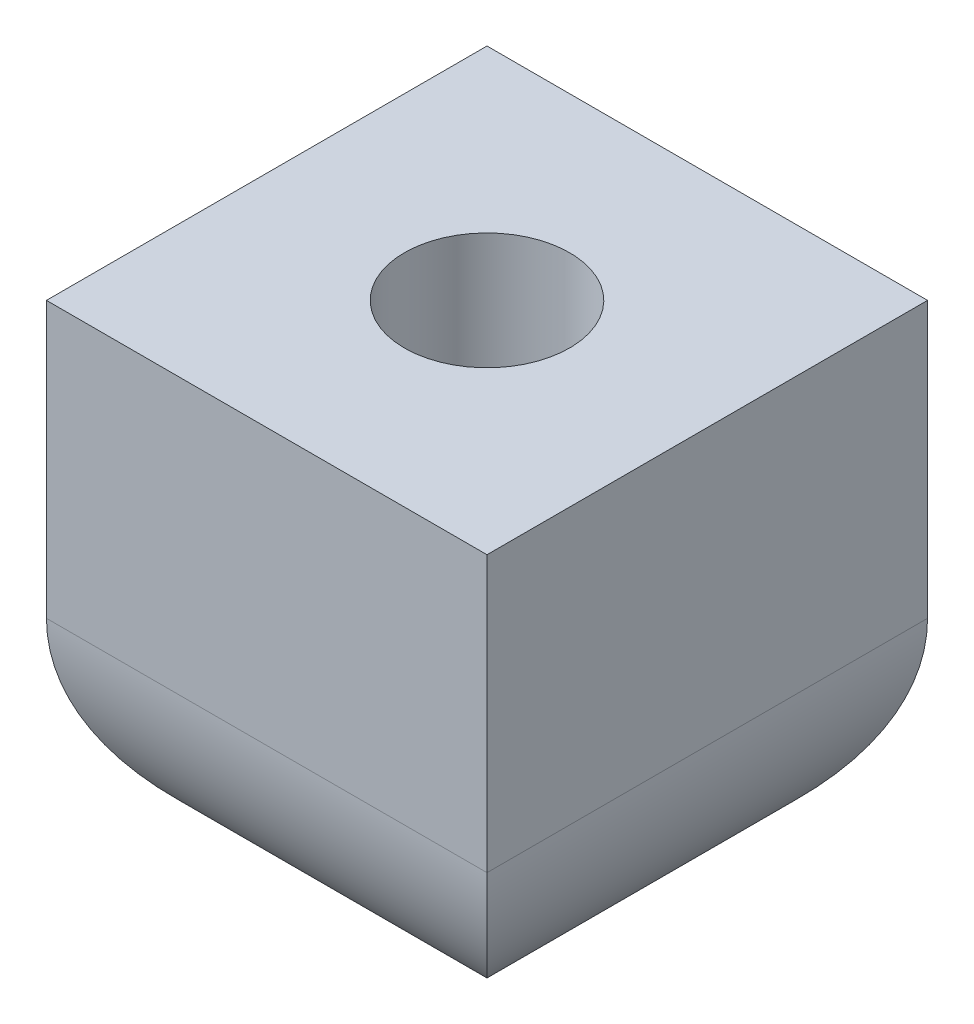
ISO-10303-21;
HEADER;
FILE_DESCRIPTION(('STEP AP214'),'2;1');
FILE_NAME('part.step','',(''),(''),'','','');
FILE_SCHEMA(('AUTOMOTIVE_DESIGN { 1 0 10303 214 1 1 1 1 }'));
ENDSEC;
DATA;
#1=APPLICATION_CONTEXT('core data for automotive mechanical design processes');
#2=APPLICATION_PROTOCOL_DEFINITION('international standard','automotive_design',2000,#1);
#3=PRODUCT_CONTEXT('',#1,'mechanical');
#4=PRODUCT('Part','Part','',(#3));
#5=PRODUCT_RELATED_PRODUCT_CATEGORY('part','',(#4));
#6=PRODUCT_DEFINITION_FORMATION('','',#4);
#7=PRODUCT_DEFINITION_CONTEXT('part definition',#1,'design');
#8=PRODUCT_DEFINITION('design','',#6,#7);
#9=PRODUCT_DEFINITION_SHAPE('','',#8);
#10=(LENGTH_UNIT() NAMED_UNIT(*) SI_UNIT(.MILLI.,.METRE.));
#11=(NAMED_UNIT(*) PLANE_ANGLE_UNIT() SI_UNIT($,.RADIAN.));
#12=(NAMED_UNIT(*) SI_UNIT($,.STERADIAN.) SOLID_ANGLE_UNIT());
#13=UNCERTAINTY_MEASURE_WITH_UNIT(LENGTH_MEASURE(1.E-05),#10,'distance_accuracy_value','');
#14=(GEOMETRIC_REPRESENTATION_CONTEXT(3) GLOBAL_UNCERTAINTY_ASSIGNED_CONTEXT((#13)) GLOBAL_UNIT_ASSIGNED_CONTEXT((#10,
#11,#12)) REPRESENTATION_CONTEXT('',''));
#15=CARTESIAN_POINT('',(0.,0.,0.));
#16=DIRECTION('',(0.,0.,1.));
#17=DIRECTION('',(1.,0.,0.));
#18=AXIS2_PLACEMENT_3D('',#15,#16,#17);
#19=CARTESIAN_POINT('',(-4.,4.5,4.));
#20=DIRECTION('',(0.,0.,-1.));
#21=DIRECTION('',(-1.,0.,0.));
#22=AXIS2_PLACEMENT_3D('',#19,#20,#21);
#23=PLANE('',#22);
#24=DIRECTION('',(0.,-1.,0.));
#25=VECTOR('',#24,1.);
#26=CARTESIAN_POINT('',(-4.,4.5,4.));
#27=LINE('',#26,#25);
#28=CARTESIAN_POINT('',(-4.,4.5,4.));
#29=VERTEX_POINT('',#28);
#30=CARTESIAN_POINT('',(-4.,-0.5,4.));
#31=VERTEX_POINT('',#30);
#32=EDGE_CURVE('E139',#29,#31,#27,.T.);
#33=ORIENTED_EDGE('',*,*,#32,.T.);
#34=DIRECTION('',(1.,0.,0.));
#35=VECTOR('',#34,1.);
#36=CARTESIAN_POINT('',(-4.,-0.5,4.));
#37=LINE('',#36,#35);
#38=CARTESIAN_POINT('',(4.,-0.5,4.));
#39=VERTEX_POINT('',#38);
#40=EDGE_CURVE('E11',#31,#39,#37,.T.);
#41=ORIENTED_EDGE('',*,*,#40,.T.);
#42=DIRECTION('',(0.,-1.,0.));
#43=VECTOR('',#42,1.);
#44=CARTESIAN_POINT('',(4.,4.5,4.));
#45=LINE('',#44,#43);
#46=CARTESIAN_POINT('',(4.,4.5,4.));
#47=VERTEX_POINT('',#46);
#48=EDGE_CURVE('E128',#47,#39,#45,.T.);
#49=ORIENTED_EDGE('',*,*,#48,.F.);
#50=DIRECTION('',(1.,0.,0.));
#51=VECTOR('',#50,1.);
#52=CARTESIAN_POINT('',(-4.,4.5,4.));
#53=LINE('',#52,#51);
#54=EDGE_CURVE('E97',#29,#47,#53,.T.);
#55=ORIENTED_EDGE('',*,*,#54,.F.);
#56=EDGE_LOOP('',(#33,#41,#49,#55));
#57=FACE_BOUND('',#56,.T.);
#58=ADVANCED_FACE('F43',(#57),#23,.F.);
#59=CARTESIAN_POINT('',(4.,4.5,4.));
#60=DIRECTION('',(-1.,0.,0.));
#61=DIRECTION('',(0.,0.,1.));
#62=AXIS2_PLACEMENT_3D('',#59,#60,#61);
#63=PLANE('',#62);
#64=ORIENTED_EDGE('',*,*,#48,.T.);
#65=DIRECTION('',(0.,0.,-1.));
#66=VECTOR('',#65,1.);
#67=CARTESIAN_POINT('',(4.,-0.5,4.));
#68=LINE('',#67,#66);
#69=CARTESIAN_POINT('',(4.,-0.5,-4.));
#70=VERTEX_POINT('',#69);
#71=EDGE_CURVE('E54',#39,#70,#68,.T.);
#72=ORIENTED_EDGE('',*,*,#71,.T.);
#73=DIRECTION('',(0.,-1.,0.));
#74=VECTOR('',#73,1.);
#75=CARTESIAN_POINT('',(4.,4.5,-4.));
#76=LINE('',#75,#74);
#77=CARTESIAN_POINT('',(4.,4.5,-4.));
#78=VERTEX_POINT('',#77);
#79=EDGE_CURVE('E131',#78,#70,#76,.T.);
#80=ORIENTED_EDGE('',*,*,#79,.F.);
#81=DIRECTION('',(0.,0.,-1.));
#82=VECTOR('',#81,1.);
#83=CARTESIAN_POINT('',(4.,4.5,4.));
#84=LINE('',#83,#82);
#85=EDGE_CURVE('E84',#47,#78,#84,.T.);
#86=ORIENTED_EDGE('',*,*,#85,.F.);
#87=EDGE_LOOP('',(#64,#72,#80,#86));
#88=FACE_BOUND('',#87,.T.);
#89=ADVANCED_FACE('F168',(#88),#63,.F.);
#90=CARTESIAN_POINT('',(-4.,4.5,-4.));
#91=DIRECTION('',(0.,0.,-1.));
#92=DIRECTION('',(-1.,0.,0.));
#93=AXIS2_PLACEMENT_3D('',#90,#91,#92);
#94=PLANE('',#93);
#95=ORIENTED_EDGE('',*,*,#79,.T.);
#96=DIRECTION('',(1.,0.,0.));
#97=VECTOR('',#96,1.);
#98=CARTESIAN_POINT('',(-4.,-0.5,-4.));
#99=LINE('',#98,#97);
#100=CARTESIAN_POINT('',(-4.,-0.5,-4.));
#101=VERTEX_POINT('',#100);
#102=EDGE_CURVE('E103',#70,#101,#99,.F.);
#103=ORIENTED_EDGE('',*,*,#102,.T.);
#104=DIRECTION('',(0.,-1.,0.));
#105=VECTOR('',#104,1.);
#106=CARTESIAN_POINT('',(-4.,4.5,-4.));
#107=LINE('',#106,#105);
#108=CARTESIAN_POINT('',(-4.,4.5,-4.));
#109=VERTEX_POINT('',#108);
#110=EDGE_CURVE('E135',#109,#101,#107,.T.);
#111=ORIENTED_EDGE('',*,*,#110,.F.);
#112=DIRECTION('',(1.,0.,0.));
#113=VECTOR('',#112,1.);
#114=CARTESIAN_POINT('',(-4.,4.5,-4.));
#115=LINE('',#114,#113);
#116=EDGE_CURVE('E146',#109,#78,#115,.T.);
#117=ORIENTED_EDGE('',*,*,#116,.T.);
#118=EDGE_LOOP('',(#95,#103,#111,#117));
#119=FACE_BOUND('',#118,.T.);
#120=ADVANCED_FACE('F170',(#119),#94,.T.);
#121=CARTESIAN_POINT('',(-4.,4.5,4.));
#122=DIRECTION('',(-1.,0.,0.));
#123=DIRECTION('',(0.,0.,1.));
#124=AXIS2_PLACEMENT_3D('',#121,#122,#123);
#125=PLANE('',#124);
#126=ORIENTED_EDGE('',*,*,#110,.T.);
#127=DIRECTION('',(0.,0.,-1.));
#128=VECTOR('',#127,1.);
#129=CARTESIAN_POINT('',(-4.,-0.5,4.));
#130=LINE('',#129,#128);
#131=EDGE_CURVE('E113',#101,#31,#130,.F.);
#132=ORIENTED_EDGE('',*,*,#131,.T.);
#133=ORIENTED_EDGE('',*,*,#32,.F.);
#134=DIRECTION('',(0.,0.,-1.));
#135=VECTOR('',#134,1.);
#136=CARTESIAN_POINT('',(-4.,4.5,4.));
#137=LINE('',#136,#135);
#138=EDGE_CURVE('E142',#29,#109,#137,.T.);
#139=ORIENTED_EDGE('',*,*,#138,.T.);
#140=EDGE_LOOP('',(#126,#132,#133,#139));
#141=FACE_BOUND('',#140,.T.);
#142=ADVANCED_FACE('F163',(#141),#125,.T.);
#143=CARTESIAN_POINT('',(0.,4.5,0.));
#144=DIRECTION('',(0.,1.,0.));
#145=DIRECTION('',(0.,0.,1.));
#146=AXIS2_PLACEMENT_3D('',#143,#144,#145);
#147=PLANE('',#146);
#148=CARTESIAN_POINT('',(0.,4.5,0.));
#149=DIRECTION('',(0.,1.,0.));
#150=DIRECTION('',(0.,0.,1.));
#151=AXIS2_PLACEMENT_3D('',#148,#149,#150);
#152=CIRCLE('',#151,1.5);
#153=CARTESIAN_POINT('',(0.,4.5,1.5));
#154=VERTEX_POINT('',#153);
#155=EDGE_CURVE('E119',#154,#154,#152,.T.);
#156=ORIENTED_EDGE('',*,*,#155,.F.);
#157=EDGE_LOOP('',(#156));
#158=FACE_BOUND('',#157,.T.);
#159=ORIENTED_EDGE('',*,*,#54,.T.);
#160=ORIENTED_EDGE('',*,*,#85,.T.);
#161=ORIENTED_EDGE('',*,*,#116,.F.);
#162=ORIENTED_EDGE('',*,*,#138,.F.);
#163=EDGE_LOOP('',(#159,#160,#161,#162));
#164=FACE_BOUND('',#163,.T.);
#165=ADVANCED_FACE('F160',(#158,#164),#147,.T.);
#166=CARTESIAN_POINT('',(0.,-0.5,4.));
#167=DIRECTION('',(0.,0.,-1.));
#168=DIRECTION('',(-1.,0.,0.));
#169=AXIS2_PLACEMENT_3D('',#166,#167,#168);
#170=CYLINDRICAL_SURFACE('',#169,4.);
#171=CARTESIAN_POINT('',(0.,-0.5,0.));
#172=DIRECTION('',(-0.707106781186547,0.,-0.707106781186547));
#173=DIRECTION('',(0.707106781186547,0.,-0.707106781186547));
#174=AXIS2_PLACEMENT_3D('',#171,#172,#173);
#175=ELLIPSE('',#174,5.65685424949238,4.);
#176=CARTESIAN_POINT('',(0.,-4.5,0.));
#177=VERTEX_POINT('',#176);
#178=EDGE_CURVE('E92',#70,#177,#175,.T.);
#179=ORIENTED_EDGE('',*,*,#178,.F.);
#180=ORIENTED_EDGE('',*,*,#71,.F.);
#181=CARTESIAN_POINT('',(0.,-0.5,0.));
#182=DIRECTION('',(0.707106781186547,0.,-0.707106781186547));
#183=DIRECTION('',(0.707106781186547,0.,0.707106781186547));
#184=AXIS2_PLACEMENT_3D('',#181,#182,#183);
#185=ELLIPSE('',#184,5.65685424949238,4.);
#186=EDGE_CURVE('E47',#177,#39,#185,.F.);
#187=ORIENTED_EDGE('',*,*,#186,.F.);
#188=EDGE_LOOP('',(#179,#180,#187));
#189=FACE_BOUND('',#188,.T.);
#190=ADVANCED_FACE('F45',(#189),#170,.T.);
#191=CARTESIAN_POINT('',(-4.,-0.5,0.));
#192=DIRECTION('',(1.,0.,0.));
#193=DIRECTION('',(0.,0.,-1.));
#194=AXIS2_PLACEMENT_3D('',#191,#192,#193);
#195=CYLINDRICAL_SURFACE('',#194,4.);
#196=ORIENTED_EDGE('',*,*,#186,.T.);
#197=ORIENTED_EDGE('',*,*,#40,.F.);
#198=CARTESIAN_POINT('',(0.,-0.5,0.));
#199=DIRECTION('',(0.707106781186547,0.,0.707106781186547));
#200=DIRECTION('',(0.707106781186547,0.,-0.707106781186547));
#201=AXIS2_PLACEMENT_3D('',#198,#199,#200);
#202=ELLIPSE('',#201,5.65685424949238,4.);
#203=EDGE_CURVE('E105',#177,#31,#202,.F.);
#204=ORIENTED_EDGE('',*,*,#203,.F.);
#205=EDGE_LOOP('',(#196,#197,#204));
#206=FACE_BOUND('',#205,.T.);
#207=ADVANCED_FACE('F106',(#206),#195,.T.);
#208=CARTESIAN_POINT('',(0.,-0.5,0.));
#209=DIRECTION('',(-1.,0.,0.));
#210=DIRECTION('',(0.,0.,1.));
#211=AXIS2_PLACEMENT_3D('',#208,#209,#210);
#212=CYLINDRICAL_SURFACE('',#211,4.);
#213=ORIENTED_EDGE('',*,*,#102,.F.);
#214=ORIENTED_EDGE('',*,*,#178,.T.);
#215=CARTESIAN_POINT('',(0.,-0.5,0.));
#216=DIRECTION('',(-0.707106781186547,0.,0.707106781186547));
#217=DIRECTION('',(-0.707106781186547,0.,-0.707106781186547));
#218=AXIS2_PLACEMENT_3D('',#215,#216,#217);
#219=ELLIPSE('',#218,5.65685424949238,4.);
#220=EDGE_CURVE('E102',#101,#177,#219,.T.);
#221=ORIENTED_EDGE('',*,*,#220,.F.);
#222=EDGE_LOOP('',(#213,#214,#221));
#223=FACE_BOUND('',#222,.T.);
#224=ADVANCED_FACE('F100',(#223),#212,.T.);
#225=CARTESIAN_POINT('',(0.,-0.5,0.));
#226=DIRECTION('',(0.,0.,1.));
#227=DIRECTION('',(1.,0.,0.));
#228=AXIS2_PLACEMENT_3D('',#225,#226,#227);
#229=CYLINDRICAL_SURFACE('',#228,4.);
#230=ORIENTED_EDGE('',*,*,#203,.T.);
#231=ORIENTED_EDGE('',*,*,#131,.F.);
#232=ORIENTED_EDGE('',*,*,#220,.T.);
#233=EDGE_LOOP('',(#230,#231,#232));
#234=FACE_BOUND('',#233,.T.);
#235=ADVANCED_FACE('F112',(#234),#229,.T.);
#236=CARTESIAN_POINT('',(0.,0.5,0.));
#237=DIRECTION('',(0.,1.,0.));
#238=DIRECTION('',(0.,0.,1.));
#239=AXIS2_PLACEMENT_3D('',#236,#237,#238);
#240=CYLINDRICAL_SURFACE('',#239,1.5);
#241=CARTESIAN_POINT('',(0.,0.5,0.));
#242=DIRECTION('',(0.,1.,0.));
#243=DIRECTION('',(0.,0.,1.));
#244=AXIS2_PLACEMENT_3D('',#241,#242,#243);
#245=CIRCLE('',#244,1.5);
#246=CARTESIAN_POINT('',(0.,0.5,1.5));
#247=VERTEX_POINT('',#246);
#248=EDGE_CURVE('E115',#247,#247,#245,.T.);
#249=ORIENTED_EDGE('',*,*,#248,.F.);
#250=EDGE_LOOP('',(#249));
#251=FACE_BOUND('',#250,.T.);
#252=ORIENTED_EDGE('',*,*,#155,.T.);
#253=EDGE_LOOP('',(#252));
#254=FACE_BOUND('',#253,.T.);
#255=ADVANCED_FACE('F158',(#251,#254),#240,.F.);
#256=CARTESIAN_POINT('',(0.,0.5,0.));
#257=DIRECTION('',(0.,1.,0.));
#258=DIRECTION('',(0.,0.,1.));
#259=AXIS2_PLACEMENT_3D('',#256,#257,#258);
#260=PLANE('',#259);
#261=ORIENTED_EDGE('',*,*,#248,.T.);
#262=EDGE_LOOP('',(#261));
#263=FACE_BOUND('',#262,.T.);
#264=ADVANCED_FACE('F213',(#263),#260,.T.);
#265=CLOSED_SHELL('',(#58,#89,#120,#142,#165,#190,#207,#224,#235,#255,#264));
#266=MANIFOLD_SOLID_BREP('B2',#265);
#267=ADVANCED_BREP_SHAPE_REPRESENTATION('',(#18,#266),#14);
#268=SHAPE_DEFINITION_REPRESENTATION(#9,#267);
ENDSEC;
END-ISO-10303-21;
